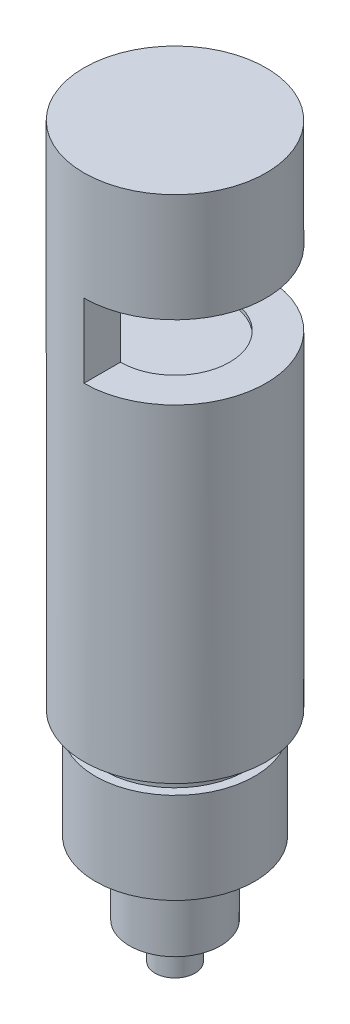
from build123d import *

# Parameters (mm, degrees)
SKETCH1_R           = 6.35
BASE_EXTRUDE_DEPTH  = 35.56
SKETCH2_W           = 6.35
SKETCH2_H           = 5.1435
CUT_EXTRUDE1_DEPTH  = 17.78
CUT_EXTRUDE2_START  = -0.254
SKETCH3_R           = 3.81
CUT_EXTRUDE2_DEPTH  = 5.6515
SKETCH4_R           = 5.55625
BOSS_EXTRUDE1_DEPTH = 7.62
SKETCH5_R           = 3.175
BOSS_EXTRUDE2_DEPTH = 5.08
SKETCH9_R           = 1.397
EXTRUDE1_DEPTH      = 2.54


with BuildPart() as part:
    # Sketch1 → Base-Extrude (new body)
    with BuildSketch(Plane(origin=(0, 0, 0), x_dir=(1, 0, 0), z_dir=(0, 1, 0))):
        with Locations(Location((0, 0, 0), (0, 0, 270))):
            Circle(SKETCH1_R)
    extrude(amount=BASE_EXTRUDE_DEPTH)

    # Sketch2 → Cut-Extrude1 (cut, symmetric)
    with BuildSketch(Plane.XY):
        with Locations((3.175, 25.43175)):
            Rectangle(SKETCH2_W, SKETCH2_H)
    extrude(amount=CUT_EXTRUDE1_DEPTH, both=True, mode=Mode.SUBTRACT)

    # Sketch3 → Cut-Extrude2 (cut)
    with BuildSketch(Plane(origin=(0, 22.86, 0), x_dir=(-1, 0, 0), z_dir=(0, 1, 0)).offset(CUT_EXTRUDE2_START)):
        with Locations(Location((0, 0, 0), (0, 0, 90))):
            Circle(SKETCH3_R)
    extrude(amount=CUT_EXTRUDE2_DEPTH, mode=Mode.SUBTRACT)

    # Sketch4 → Boss-Extrude1 (add)
    with BuildSketch(Plane.XZ):
        with Locations(Location((0, 0, 0), (0, 0, 90))):
            Circle(SKETCH4_R)
    extrude(amount=BOSS_EXTRUDE1_DEPTH)

    # Sketch5 → Boss-Extrude2 (add)
    with BuildSketch(Plane.XZ.offset(7.62)):
        with Locations(Location((0, 0, 0), (0, 0, 270))):
            Circle(SKETCH5_R)
    extrude(amount=BOSS_EXTRUDE2_DEPTH)

    # Sketch6 → Cut-Revolve1 (revolve, cut)
    with BuildSketch(Plane.XY):
        Polygon((-6.35, 0), (-4.9149, 1.4351), (-4.9149, -1.27), (-5.55625, -1.27), (-5.55625, 0), align=None)
    revolve(axis=Axis((0, 0, 0), (0, -1, 0)), mode=Mode.SUBTRACT)

    # Sketch9 → Extrude1 (add)
    with BuildSketch(Plane.XZ.offset(12.7)):
        Circle(SKETCH9_R)
    extrude(amount=EXTRUDE1_DEPTH)


solid = part.part
